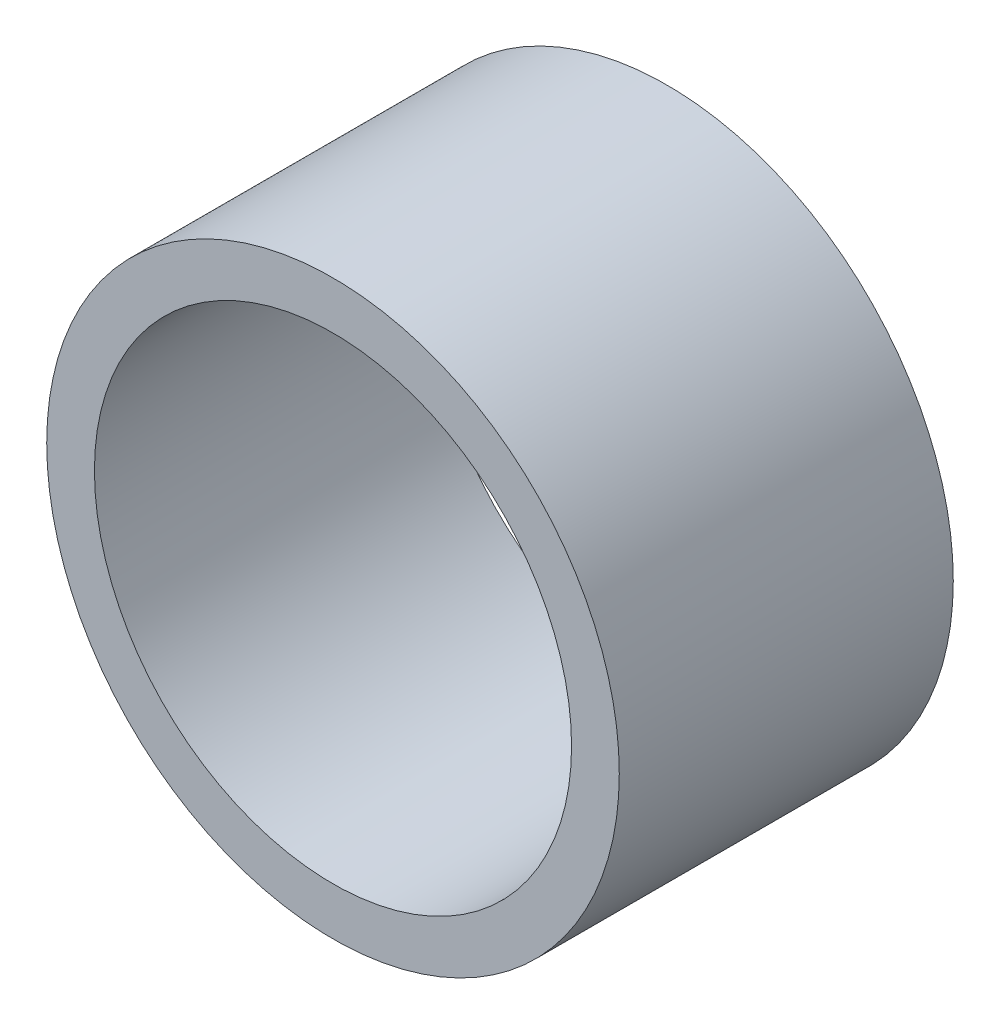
ISO-10303-21;
HEADER;
FILE_DESCRIPTION(('STEP AP214'),'2;1');
FILE_NAME('part.step','',(''),(''),'','','');
FILE_SCHEMA(('AUTOMOTIVE_DESIGN { 1 0 10303 214 1 1 1 1 }'));
ENDSEC;
DATA;
#1=APPLICATION_CONTEXT('core data for automotive mechanical design processes');
#2=APPLICATION_PROTOCOL_DEFINITION('international standard','automotive_design',2000,#1);
#3=PRODUCT_CONTEXT('',#1,'mechanical');
#4=PRODUCT('Part','Part','',(#3));
#5=PRODUCT_RELATED_PRODUCT_CATEGORY('part','',(#4));
#6=PRODUCT_DEFINITION_FORMATION('','',#4);
#7=PRODUCT_DEFINITION_CONTEXT('part definition',#1,'design');
#8=PRODUCT_DEFINITION('design','',#6,#7);
#9=PRODUCT_DEFINITION_SHAPE('','',#8);
#10=(LENGTH_UNIT() NAMED_UNIT(*) SI_UNIT(.MILLI.,.METRE.));
#11=(NAMED_UNIT(*) PLANE_ANGLE_UNIT() SI_UNIT($,.RADIAN.));
#12=(NAMED_UNIT(*) SI_UNIT($,.STERADIAN.) SOLID_ANGLE_UNIT());
#13=UNCERTAINTY_MEASURE_WITH_UNIT(LENGTH_MEASURE(1.E-05),#10,'distance_accuracy_value','');
#14=(GEOMETRIC_REPRESENTATION_CONTEXT(3) GLOBAL_UNCERTAINTY_ASSIGNED_CONTEXT((#13)) GLOBAL_UNIT_ASSIGNED_CONTEXT((#10,
#11,#12)) REPRESENTATION_CONTEXT('',''));
#15=CARTESIAN_POINT('',(0.,0.,0.));
#16=DIRECTION('',(0.,0.,1.));
#17=DIRECTION('',(1.,0.,0.));
#18=AXIS2_PLACEMENT_3D('',#15,#16,#17);
#19=CARTESIAN_POINT('',(0.,0.,14.));
#20=DIRECTION('',(0.,0.,1.));
#21=DIRECTION('',(1.,0.,0.));
#22=AXIS2_PLACEMENT_3D('',#19,#20,#21);
#23=PLANE('',#22);
#24=CARTESIAN_POINT('',(0.,0.,14.));
#25=DIRECTION('',(0.,0.,1.));
#26=DIRECTION('',(1.,0.,0.));
#27=AXIS2_PLACEMENT_3D('',#24,#25,#26);
#28=CIRCLE('',#27,12.);
#29=CARTESIAN_POINT('',(12.,0.,14.));
#30=VERTEX_POINT('',#29);
#31=EDGE_CURVE('E10',#30,#30,#28,.T.);
#32=ORIENTED_EDGE('',*,*,#31,.T.);
#33=EDGE_LOOP('',(#32));
#34=FACE_BOUND('',#33,.T.);
#35=CARTESIAN_POINT('',(0.,0.,14.));
#36=DIRECTION('',(0.,0.,1.));
#37=DIRECTION('',(1.,0.,0.));
#38=AXIS2_PLACEMENT_3D('',#35,#36,#37);
#39=CIRCLE('',#38,10.);
#40=CARTESIAN_POINT('',(10.,0.,14.));
#41=VERTEX_POINT('',#40);
#42=EDGE_CURVE('E44',#41,#41,#39,.T.);
#43=ORIENTED_EDGE('',*,*,#42,.F.);
#44=EDGE_LOOP('',(#43));
#45=FACE_BOUND('',#44,.T.);
#46=ADVANCED_FACE('F33',(#34,#45),#23,.T.);
#47=CARTESIAN_POINT('',(0.,0.,0.));
#48=DIRECTION('',(0.,0.,1.));
#49=DIRECTION('',(1.,0.,0.));
#50=AXIS2_PLACEMENT_3D('',#47,#48,#49);
#51=PLANE('',#50);
#52=CARTESIAN_POINT('',(0.,0.,0.));
#53=DIRECTION('',(0.,0.,1.));
#54=DIRECTION('',(1.,0.,0.));
#55=AXIS2_PLACEMENT_3D('',#52,#53,#54);
#56=CIRCLE('',#55,12.);
#57=CARTESIAN_POINT('',(12.,0.,0.));
#58=VERTEX_POINT('',#57);
#59=EDGE_CURVE('E40',#58,#58,#56,.T.);
#60=ORIENTED_EDGE('',*,*,#59,.F.);
#61=EDGE_LOOP('',(#60));
#62=FACE_BOUND('',#61,.T.);
#63=CARTESIAN_POINT('',(0.,0.,0.));
#64=DIRECTION('',(0.,0.,1.));
#65=DIRECTION('',(1.,0.,0.));
#66=AXIS2_PLACEMENT_3D('',#63,#64,#65);
#67=CIRCLE('',#66,10.);
#68=CARTESIAN_POINT('',(10.,0.,0.));
#69=VERTEX_POINT('',#68);
#70=EDGE_CURVE('E48',#69,#69,#67,.T.);
#71=ORIENTED_EDGE('',*,*,#70,.T.);
#72=EDGE_LOOP('',(#71));
#73=FACE_BOUND('',#72,.T.);
#74=ADVANCED_FACE('F54',(#62,#73),#51,.F.);
#75=CARTESIAN_POINT('',(0.,0.,14.));
#76=DIRECTION('',(0.,0.,-1.));
#77=DIRECTION('',(-1.,0.,0.));
#78=AXIS2_PLACEMENT_3D('',#75,#76,#77);
#79=CYLINDRICAL_SURFACE('',#78,12.);
#80=ORIENTED_EDGE('',*,*,#31,.F.);
#81=EDGE_LOOP('',(#80));
#82=FACE_BOUND('',#81,.T.);
#83=ORIENTED_EDGE('',*,*,#59,.T.);
#84=EDGE_LOOP('',(#83));
#85=FACE_BOUND('',#84,.T.);
#86=ADVANCED_FACE('F35',(#82,#85),#79,.T.);
#87=CARTESIAN_POINT('',(0.,0.,14.));
#88=DIRECTION('',(0.,0.,-1.));
#89=DIRECTION('',(-1.,0.,0.));
#90=AXIS2_PLACEMENT_3D('',#87,#88,#89);
#91=CYLINDRICAL_SURFACE('',#90,10.);
#92=ORIENTED_EDGE('',*,*,#42,.T.);
#93=EDGE_LOOP('',(#92));
#94=FACE_BOUND('',#93,.T.);
#95=ORIENTED_EDGE('',*,*,#70,.F.);
#96=EDGE_LOOP('',(#95));
#97=FACE_BOUND('',#96,.T.);
#98=ADVANCED_FACE('F56',(#94,#97),#91,.F.);
#99=CLOSED_SHELL('',(#46,#74,#86,#98));
#100=MANIFOLD_SOLID_BREP('B2',#99);
#101=ADVANCED_BREP_SHAPE_REPRESENTATION('',(#18,#100),#14);
#102=SHAPE_DEFINITION_REPRESENTATION(#9,#101);
ENDSEC;
END-ISO-10303-21;
